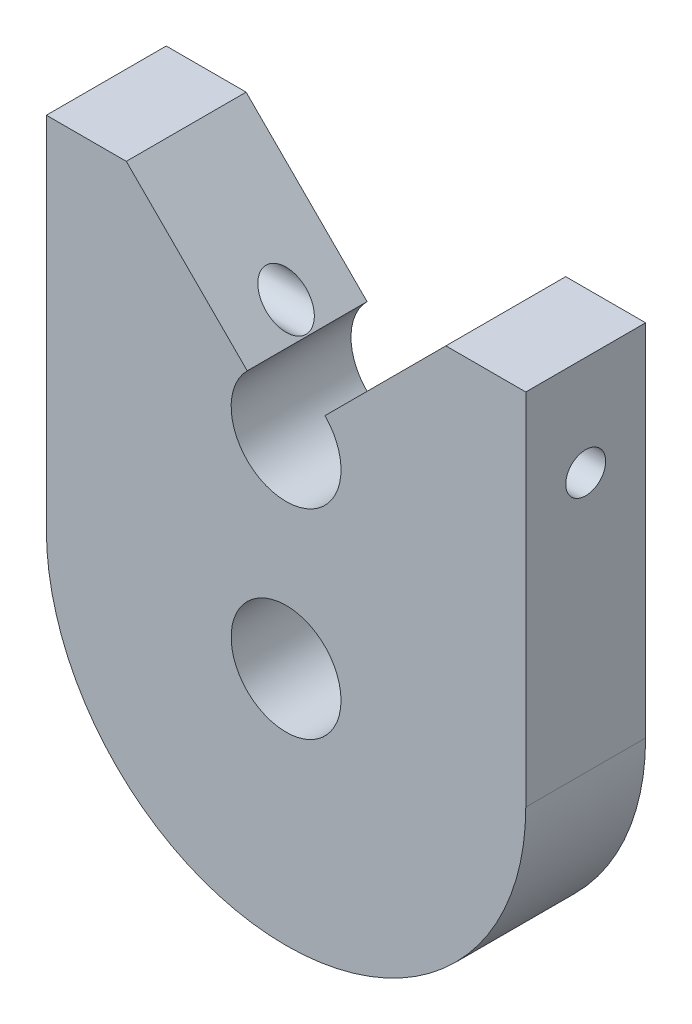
ISO-10303-21;
HEADER;
FILE_DESCRIPTION(('STEP AP214'),'2;1');
FILE_NAME('part.step','',(''),(''),'','','');
FILE_SCHEMA(('AUTOMOTIVE_DESIGN { 1 0 10303 214 1 1 1 1 }'));
ENDSEC;
DATA;
#1=APPLICATION_CONTEXT('core data for automotive mechanical design processes');
#2=APPLICATION_PROTOCOL_DEFINITION('international standard','automotive_design',2000,#1);
#3=PRODUCT_CONTEXT('',#1,'mechanical');
#4=PRODUCT('Part','Part','',(#3));
#5=PRODUCT_RELATED_PRODUCT_CATEGORY('part','',(#4));
#6=PRODUCT_DEFINITION_FORMATION('','',#4);
#7=PRODUCT_DEFINITION_CONTEXT('part definition',#1,'design');
#8=PRODUCT_DEFINITION('design','',#6,#7);
#9=PRODUCT_DEFINITION_SHAPE('','',#8);
#10=(LENGTH_UNIT() NAMED_UNIT(*) SI_UNIT(.MILLI.,.METRE.));
#11=(NAMED_UNIT(*) PLANE_ANGLE_UNIT() SI_UNIT($,.RADIAN.));
#12=(NAMED_UNIT(*) SI_UNIT($,.STERADIAN.) SOLID_ANGLE_UNIT());
#13=UNCERTAINTY_MEASURE_WITH_UNIT(LENGTH_MEASURE(1.E-05),#10,'distance_accuracy_value','');
#14=(GEOMETRIC_REPRESENTATION_CONTEXT(3) GLOBAL_UNCERTAINTY_ASSIGNED_CONTEXT((#13)) GLOBAL_UNIT_ASSIGNED_CONTEXT((#10,
#11,#12)) REPRESENTATION_CONTEXT('',''));
#15=CARTESIAN_POINT('',(0.,0.,0.));
#16=DIRECTION('',(0.,0.,1.));
#17=DIRECTION('',(1.,0.,0.));
#18=AXIS2_PLACEMENT_3D('',#15,#16,#17);
#19=CARTESIAN_POINT('',(0.,10.,6.));
#20=DIRECTION('',(0.,0.,1.));
#21=DIRECTION('',(1.,0.,0.));
#22=AXIS2_PLACEMENT_3D('',#19,#20,#21);
#23=PLANE('',#22);
#24=CARTESIAN_POINT('',(0.,10.,6.));
#25=DIRECTION('',(0.,0.,-1.));
#26=DIRECTION('',(1.,0.,0.));
#27=AXIS2_PLACEMENT_3D('',#24,#25,#26);
#28=CIRCLE('',#27,2.75);
#29=CARTESIAN_POINT('',(1.94454364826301,11.944543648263,6.));
#30=VERTEX_POINT('',#29);
#31=CARTESIAN_POINT('',(-1.94454364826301,11.944543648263,6.));
#32=VERTEX_POINT('',#31);
#33=EDGE_CURVE('E144',#30,#32,#28,.T.);
#34=ORIENTED_EDGE('',*,*,#33,.T.);
#35=DIRECTION('',(-0.707106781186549,0.707106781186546,0.));
#36=VECTOR('',#35,1.);
#37=CARTESIAN_POINT('',(-1.94454364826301,11.944543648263,6.));
#38=LINE('',#37,#36);
#39=CARTESIAN_POINT('',(-8.00000000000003,18.,6.));
#40=VERTEX_POINT('',#39);
#41=EDGE_CURVE('E92',#32,#40,#38,.T.);
#42=ORIENTED_EDGE('',*,*,#41,.T.);
#43=DIRECTION('',(-1.,0.,0.));
#44=VECTOR('',#43,1.);
#45=CARTESIAN_POINT('',(-12.,18.,6.));
#46=LINE('',#45,#44);
#47=CARTESIAN_POINT('',(-12.,18.,6.));
#48=VERTEX_POINT('',#47);
#49=EDGE_CURVE('E160',#40,#48,#46,.T.);
#50=ORIENTED_EDGE('',*,*,#49,.T.);
#51=DIRECTION('',(0.,-1.,0.));
#52=VECTOR('',#51,1.);
#53=CARTESIAN_POINT('',(-12.,0.,6.));
#54=LINE('',#53,#52);
#55=CARTESIAN_POINT('',(-12.,0.,6.));
#56=VERTEX_POINT('',#55);
#57=EDGE_CURVE('E173',#48,#56,#54,.T.);
#58=ORIENTED_EDGE('',*,*,#57,.T.);
#59=CARTESIAN_POINT('',(0.,0.,6.));
#60=DIRECTION('',(0.,0.,1.));
#61=DIRECTION('',(1.,0.,0.));
#62=AXIS2_PLACEMENT_3D('',#59,#60,#61);
#63=CIRCLE('',#62,12.);
#64=CARTESIAN_POINT('',(12.,0.,6.));
#65=VERTEX_POINT('',#64);
#66=EDGE_CURVE('E111',#56,#65,#63,.T.);
#67=ORIENTED_EDGE('',*,*,#66,.T.);
#68=DIRECTION('',(0.,1.,0.));
#69=VECTOR('',#68,1.);
#70=CARTESIAN_POINT('',(12.,0.,6.));
#71=LINE('',#70,#69);
#72=CARTESIAN_POINT('',(12.,18.,6.));
#73=VERTEX_POINT('',#72);
#74=EDGE_CURVE('E105',#65,#73,#71,.T.);
#75=ORIENTED_EDGE('',*,*,#74,.T.);
#76=DIRECTION('',(-1.,0.,0.));
#77=VECTOR('',#76,1.);
#78=CARTESIAN_POINT('',(12.,18.,6.));
#79=LINE('',#78,#77);
#80=CARTESIAN_POINT('',(8.00000000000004,18.,6.));
#81=VERTEX_POINT('',#80);
#82=EDGE_CURVE('E109',#73,#81,#79,.T.);
#83=ORIENTED_EDGE('',*,*,#82,.T.);
#84=DIRECTION('',(-0.707106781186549,-0.707106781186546,0.));
#85=VECTOR('',#84,1.);
#86=CARTESIAN_POINT('',(1.94454364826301,11.944543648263,6.));
#87=LINE('',#86,#85);
#88=EDGE_CURVE('E49',#81,#30,#87,.T.);
#89=ORIENTED_EDGE('',*,*,#88,.T.);
#90=EDGE_LOOP('',(#34,#42,#50,#58,#67,#75,#83,#89));
#91=FACE_BOUND('',#90,.T.);
#92=CARTESIAN_POINT('',(0.,0.,6.));
#93=DIRECTION('',(0.,0.,1.));
#94=DIRECTION('',(1.,0.,0.));
#95=AXIS2_PLACEMENT_3D('',#92,#93,#94);
#96=CIRCLE('',#95,2.75);
#97=CARTESIAN_POINT('',(2.75,0.,6.));
#98=VERTEX_POINT('',#97);
#99=EDGE_CURVE('E133',#98,#98,#96,.T.);
#100=ORIENTED_EDGE('',*,*,#99,.F.);
#101=EDGE_LOOP('',(#100));
#102=FACE_BOUND('',#101,.T.);
#103=ADVANCED_FACE('F31',(#91,#102),#23,.T.);
#104=CARTESIAN_POINT('',(0.,10.,0.));
#105=DIRECTION('',(0.,0.,1.));
#106=DIRECTION('',(1.,0.,0.));
#107=AXIS2_PLACEMENT_3D('',#104,#105,#106);
#108=PLANE('',#107);
#109=CARTESIAN_POINT('',(0.,10.,0.));
#110=DIRECTION('',(0.,0.,-1.));
#111=DIRECTION('',(1.,0.,0.));
#112=AXIS2_PLACEMENT_3D('',#109,#110,#111);
#113=CIRCLE('',#112,2.75);
#114=CARTESIAN_POINT('',(1.94454364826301,11.944543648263,0.));
#115=VERTEX_POINT('',#114);
#116=CARTESIAN_POINT('',(-1.94454364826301,11.944543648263,0.));
#117=VERTEX_POINT('',#116);
#118=EDGE_CURVE('E129',#115,#117,#113,.T.);
#119=ORIENTED_EDGE('',*,*,#118,.F.);
#120=DIRECTION('',(-0.707106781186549,-0.707106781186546,0.));
#121=VECTOR('',#120,1.);
#122=CARTESIAN_POINT('',(1.94454364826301,11.944543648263,0.));
#123=LINE('',#122,#121);
#124=CARTESIAN_POINT('',(8.00000000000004,18.,0.));
#125=VERTEX_POINT('',#124);
#126=EDGE_CURVE('E84',#125,#115,#123,.T.);
#127=ORIENTED_EDGE('',*,*,#126,.F.);
#128=DIRECTION('',(-1.,0.,0.));
#129=VECTOR('',#128,1.);
#130=CARTESIAN_POINT('',(12.,18.,0.));
#131=LINE('',#130,#129);
#132=CARTESIAN_POINT('',(12.,18.,0.));
#133=VERTEX_POINT('',#132);
#134=EDGE_CURVE('E78',#133,#125,#131,.T.);
#135=ORIENTED_EDGE('',*,*,#134,.F.);
#136=DIRECTION('',(0.,1.,0.));
#137=VECTOR('',#136,1.);
#138=CARTESIAN_POINT('',(12.,0.,0.));
#139=LINE('',#138,#137);
#140=CARTESIAN_POINT('',(12.,0.,0.));
#141=VERTEX_POINT('',#140);
#142=EDGE_CURVE('E119',#141,#133,#139,.T.);
#143=ORIENTED_EDGE('',*,*,#142,.F.);
#144=CARTESIAN_POINT('',(0.,0.,0.));
#145=DIRECTION('',(0.,0.,1.));
#146=DIRECTION('',(1.,0.,0.));
#147=AXIS2_PLACEMENT_3D('',#144,#145,#146);
#148=CIRCLE('',#147,12.);
#149=CARTESIAN_POINT('',(-12.,0.,0.));
#150=VERTEX_POINT('',#149);
#151=EDGE_CURVE('E139',#150,#141,#148,.T.);
#152=ORIENTED_EDGE('',*,*,#151,.F.);
#153=DIRECTION('',(0.,-1.,0.));
#154=VECTOR('',#153,1.);
#155=CARTESIAN_POINT('',(-12.,0.,0.));
#156=LINE('',#155,#154);
#157=CARTESIAN_POINT('',(-12.,18.,0.));
#158=VERTEX_POINT('',#157);
#159=EDGE_CURVE('E137',#158,#150,#156,.T.);
#160=ORIENTED_EDGE('',*,*,#159,.F.);
#161=DIRECTION('',(-1.,0.,0.));
#162=VECTOR('',#161,1.);
#163=CARTESIAN_POINT('',(-12.,18.,0.));
#164=LINE('',#163,#162);
#165=CARTESIAN_POINT('',(-8.00000000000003,18.,0.));
#166=VERTEX_POINT('',#165);
#167=EDGE_CURVE('E135',#166,#158,#164,.T.);
#168=ORIENTED_EDGE('',*,*,#167,.F.);
#169=DIRECTION('',(-0.707106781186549,0.707106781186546,0.));
#170=VECTOR('',#169,1.);
#171=CARTESIAN_POINT('',(-1.94454364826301,11.944543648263,0.));
#172=LINE('',#171,#170);
#173=EDGE_CURVE('E132',#117,#166,#172,.T.);
#174=ORIENTED_EDGE('',*,*,#173,.F.);
#175=EDGE_LOOP('',(#119,#127,#135,#143,#152,#160,#168,#174));
#176=FACE_BOUND('',#175,.T.);
#177=CARTESIAN_POINT('',(0.,0.,0.));
#178=DIRECTION('',(0.,0.,1.));
#179=DIRECTION('',(1.,0.,0.));
#180=AXIS2_PLACEMENT_3D('',#177,#178,#179);
#181=CIRCLE('',#180,2.75);
#182=CARTESIAN_POINT('',(2.75,0.,0.));
#183=VERTEX_POINT('',#182);
#184=EDGE_CURVE('E179',#183,#183,#181,.T.);
#185=ORIENTED_EDGE('',*,*,#184,.T.);
#186=EDGE_LOOP('',(#185));
#187=FACE_BOUND('',#186,.T.);
#188=ADVANCED_FACE('F164',(#176,#187),#108,.F.);
#189=CARTESIAN_POINT('',(0.,10.,6.));
#190=DIRECTION('',(0.,0.,-1.));
#191=DIRECTION('',(-1.,0.,0.));
#192=AXIS2_PLACEMENT_3D('',#189,#190,#191);
#193=CYLINDRICAL_SURFACE('',#192,2.75);
#194=ORIENTED_EDGE('',*,*,#118,.T.);
#195=DIRECTION('',(0.,0.,-1.));
#196=VECTOR('',#195,1.);
#197=CARTESIAN_POINT('',(-1.94454364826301,11.944543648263,6.));
#198=LINE('',#197,#196);
#199=EDGE_CURVE('E11',#32,#117,#198,.T.);
#200=ORIENTED_EDGE('',*,*,#199,.F.);
#201=ORIENTED_EDGE('',*,*,#33,.F.);
#202=DIRECTION('',(0.,0.,-1.));
#203=VECTOR('',#202,1.);
#204=CARTESIAN_POINT('',(1.94454364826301,11.944543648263,6.));
#205=LINE('',#204,#203);
#206=EDGE_CURVE('E125',#30,#115,#205,.T.);
#207=ORIENTED_EDGE('',*,*,#206,.T.);
#208=EDGE_LOOP('',(#194,#200,#201,#207));
#209=FACE_BOUND('',#208,.T.);
#210=ADVANCED_FACE('F33',(#209),#193,.F.);
#211=CARTESIAN_POINT('',(-1.94454364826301,11.944543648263,6.));
#212=DIRECTION('',(-0.707106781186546,-0.707106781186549,0.));
#213=DIRECTION('',(0.707106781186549,-0.707106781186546,0.));
#214=AXIS2_PLACEMENT_3D('',#211,#212,#213);
#215=PLANE('',#214);
#216=CARTESIAN_POINT('',(-3.00000000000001,13.,3.));
#217=DIRECTION('',(-0.707106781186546,-0.707106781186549,0.));
#218=DIRECTION('',(0.707106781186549,-0.707106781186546,0.));
#219=AXIS2_PLACEMENT_3D('',#216,#217,#218);
#220=ELLIPSE('',#219,1.4142135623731,1.);
#221=CARTESIAN_POINT('',(-2.00000000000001,12.,3.));
#222=VERTEX_POINT('',#221);
#223=EDGE_CURVE('E182',#222,#222,#220,.T.);
#224=ORIENTED_EDGE('',*,*,#223,.T.);
#225=EDGE_LOOP('',(#224));
#226=FACE_BOUND('',#225,.T.);
#227=ORIENTED_EDGE('',*,*,#173,.T.);
#228=DIRECTION('',(0.,0.,-1.));
#229=VECTOR('',#228,1.);
#230=CARTESIAN_POINT('',(-8.00000000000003,18.,6.));
#231=LINE('',#230,#229);
#232=EDGE_CURVE('E41',#40,#166,#231,.T.);
#233=ORIENTED_EDGE('',*,*,#232,.F.);
#234=ORIENTED_EDGE('',*,*,#41,.F.);
#235=ORIENTED_EDGE('',*,*,#199,.T.);
#236=EDGE_LOOP('',(#227,#233,#234,#235));
#237=FACE_BOUND('',#236,.T.);
#238=ADVANCED_FACE('F231',(#226,#237),#215,.F.);
#239=CARTESIAN_POINT('',(-12.,18.,6.));
#240=DIRECTION('',(0.,-1.,0.));
#241=DIRECTION('',(1.,0.,0.));
#242=AXIS2_PLACEMENT_3D('',#239,#240,#241);
#243=PLANE('',#242);
#244=ORIENTED_EDGE('',*,*,#167,.T.);
#245=DIRECTION('',(0.,0.,-1.));
#246=VECTOR('',#245,1.);
#247=CARTESIAN_POINT('',(-12.,18.,6.));
#248=LINE('',#247,#246);
#249=EDGE_CURVE('E151',#48,#158,#248,.T.);
#250=ORIENTED_EDGE('',*,*,#249,.F.);
#251=ORIENTED_EDGE('',*,*,#49,.F.);
#252=ORIENTED_EDGE('',*,*,#232,.T.);
#253=EDGE_LOOP('',(#244,#250,#251,#252));
#254=FACE_BOUND('',#253,.T.);
#255=ADVANCED_FACE('F158',(#254),#243,.F.);
#256=CARTESIAN_POINT('',(-12.,0.,6.));
#257=DIRECTION('',(1.,0.,0.));
#258=DIRECTION('',(0.,0.,-1.));
#259=AXIS2_PLACEMENT_3D('',#256,#257,#258);
#260=PLANE('',#259);
#261=CARTESIAN_POINT('',(-12.,13.,3.));
#262=DIRECTION('',(1.,0.,0.));
#263=DIRECTION('',(0.,0.,-1.));
#264=AXIS2_PLACEMENT_3D('',#261,#262,#263);
#265=CIRCLE('',#264,1.);
#266=CARTESIAN_POINT('',(-12.,13.,2.));
#267=VERTEX_POINT('',#266);
#268=EDGE_CURVE('E190',#267,#267,#265,.T.);
#269=ORIENTED_EDGE('',*,*,#268,.T.);
#270=EDGE_LOOP('',(#269));
#271=FACE_BOUND('',#270,.T.);
#272=ORIENTED_EDGE('',*,*,#159,.T.);
#273=DIRECTION('',(0.,0.,-1.));
#274=VECTOR('',#273,1.);
#275=CARTESIAN_POINT('',(-12.,0.,6.));
#276=LINE('',#275,#274);
#277=EDGE_CURVE('E148',#56,#150,#276,.T.);
#278=ORIENTED_EDGE('',*,*,#277,.F.);
#279=ORIENTED_EDGE('',*,*,#57,.F.);
#280=ORIENTED_EDGE('',*,*,#249,.T.);
#281=EDGE_LOOP('',(#272,#278,#279,#280));
#282=FACE_BOUND('',#281,.T.);
#283=ADVANCED_FACE('F169',(#271,#282),#260,.F.);
#284=CARTESIAN_POINT('',(0.,0.,6.));
#285=DIRECTION('',(0.,0.,-1.));
#286=DIRECTION('',(-1.,0.,0.));
#287=AXIS2_PLACEMENT_3D('',#284,#285,#286);
#288=CYLINDRICAL_SURFACE('',#287,12.);
#289=ORIENTED_EDGE('',*,*,#151,.T.);
#290=DIRECTION('',(0.,0.,-1.));
#291=VECTOR('',#290,1.);
#292=CARTESIAN_POINT('',(12.,0.,6.));
#293=LINE('',#292,#291);
#294=EDGE_CURVE('E120',#65,#141,#293,.T.);
#295=ORIENTED_EDGE('',*,*,#294,.F.);
#296=ORIENTED_EDGE('',*,*,#66,.F.);
#297=ORIENTED_EDGE('',*,*,#277,.T.);
#298=EDGE_LOOP('',(#289,#295,#296,#297));
#299=FACE_BOUND('',#298,.T.);
#300=ADVANCED_FACE('F172',(#299),#288,.T.);
#301=CARTESIAN_POINT('',(12.,0.,6.));
#302=DIRECTION('',(-1.,0.,0.));
#303=DIRECTION('',(0.,0.,1.));
#304=AXIS2_PLACEMENT_3D('',#301,#302,#303);
#305=PLANE('',#304);
#306=CARTESIAN_POINT('',(12.,13.,3.));
#307=DIRECTION('',(1.,0.,0.));
#308=DIRECTION('',(0.,0.,-1.));
#309=AXIS2_PLACEMENT_3D('',#306,#307,#308);
#310=CIRCLE('',#309,1.);
#311=CARTESIAN_POINT('',(12.,13.,2.));
#312=VERTEX_POINT('',#311);
#313=EDGE_CURVE('E187',#312,#312,#310,.T.);
#314=ORIENTED_EDGE('',*,*,#313,.F.);
#315=EDGE_LOOP('',(#314));
#316=FACE_BOUND('',#315,.T.);
#317=ORIENTED_EDGE('',*,*,#142,.T.);
#318=DIRECTION('',(0.,0.,-1.));
#319=VECTOR('',#318,1.);
#320=CARTESIAN_POINT('',(12.,18.,6.));
#321=LINE('',#320,#319);
#322=EDGE_CURVE('E116',#73,#133,#321,.T.);
#323=ORIENTED_EDGE('',*,*,#322,.F.);
#324=ORIENTED_EDGE('',*,*,#74,.F.);
#325=ORIENTED_EDGE('',*,*,#294,.T.);
#326=EDGE_LOOP('',(#317,#323,#324,#325));
#327=FACE_BOUND('',#326,.T.);
#328=ADVANCED_FACE('F117',(#316,#327),#305,.F.);
#329=CARTESIAN_POINT('',(12.,18.,6.));
#330=DIRECTION('',(0.,-1.,0.));
#331=DIRECTION('',(1.,0.,0.));
#332=AXIS2_PLACEMENT_3D('',#329,#330,#331);
#333=PLANE('',#332);
#334=ORIENTED_EDGE('',*,*,#134,.T.);
#335=DIRECTION('',(0.,0.,-1.));
#336=VECTOR('',#335,1.);
#337=CARTESIAN_POINT('',(8.00000000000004,18.,6.));
#338=LINE('',#337,#336);
#339=EDGE_CURVE('E121',#81,#125,#338,.T.);
#340=ORIENTED_EDGE('',*,*,#339,.F.);
#341=ORIENTED_EDGE('',*,*,#82,.F.);
#342=ORIENTED_EDGE('',*,*,#322,.T.);
#343=EDGE_LOOP('',(#334,#340,#341,#342));
#344=FACE_BOUND('',#343,.T.);
#345=ADVANCED_FACE('F123',(#344),#333,.F.);
#346=CARTESIAN_POINT('',(1.94454364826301,11.944543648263,6.));
#347=DIRECTION('',(0.707106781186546,-0.707106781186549,0.));
#348=DIRECTION('',(0.707106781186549,0.707106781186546,0.));
#349=AXIS2_PLACEMENT_3D('',#346,#347,#348);
#350=PLANE('',#349);
#351=CARTESIAN_POINT('',(3.00000000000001,13.,3.));
#352=DIRECTION('',(0.707106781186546,-0.707106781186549,0.));
#353=DIRECTION('',(0.707106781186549,0.707106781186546,0.));
#354=AXIS2_PLACEMENT_3D('',#351,#352,#353);
#355=ELLIPSE('',#354,1.4142135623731,1.);
#356=CARTESIAN_POINT('',(4.00000000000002,14.,3.));
#357=VERTEX_POINT('',#356);
#358=EDGE_CURVE('E35',#357,#357,#355,.T.);
#359=ORIENTED_EDGE('',*,*,#358,.T.);
#360=EDGE_LOOP('',(#359));
#361=FACE_BOUND('',#360,.T.);
#362=ORIENTED_EDGE('',*,*,#126,.T.);
#363=ORIENTED_EDGE('',*,*,#206,.F.);
#364=ORIENTED_EDGE('',*,*,#88,.F.);
#365=ORIENTED_EDGE('',*,*,#339,.T.);
#366=EDGE_LOOP('',(#362,#363,#364,#365));
#367=FACE_BOUND('',#366,.T.);
#368=ADVANCED_FACE('F197',(#361,#367),#350,.F.);
#369=CARTESIAN_POINT('',(0.,0.,6.));
#370=DIRECTION('',(0.,0.,-1.));
#371=DIRECTION('',(-1.,0.,0.));
#372=AXIS2_PLACEMENT_3D('',#369,#370,#371);
#373=CYLINDRICAL_SURFACE('',#372,2.75);
#374=ORIENTED_EDGE('',*,*,#99,.T.);
#375=EDGE_LOOP('',(#374));
#376=FACE_BOUND('',#375,.T.);
#377=ORIENTED_EDGE('',*,*,#184,.F.);
#378=EDGE_LOOP('',(#377));
#379=FACE_BOUND('',#378,.T.);
#380=ADVANCED_FACE('F202',(#376,#379),#373,.F.);
#381=CARTESIAN_POINT('',(-12.,13.,3.));
#382=DIRECTION('',(1.,0.,0.));
#383=DIRECTION('',(0.,0.,-1.));
#384=AXIS2_PLACEMENT_3D('',#381,#382,#383);
#385=CYLINDRICAL_SURFACE('',#384,1.);
#386=ORIENTED_EDGE('',*,*,#313,.T.);
#387=EDGE_LOOP('',(#386));
#388=FACE_BOUND('',#387,.T.);
#389=ORIENTED_EDGE('',*,*,#358,.F.);
#390=EDGE_LOOP('',(#389));
#391=FACE_BOUND('',#390,.T.);
#392=ADVANCED_FACE('F199',(#388,#391),#385,.F.);
#393=ORIENTED_EDGE('',*,*,#268,.F.);
#394=EDGE_LOOP('',(#393));
#395=FACE_BOUND('',#394,.T.);
#396=ORIENTED_EDGE('',*,*,#223,.F.);
#397=EDGE_LOOP('',(#396));
#398=FACE_BOUND('',#397,.T.);
#399=ADVANCED_FACE('F201',(#395,#398),#385,.F.);
#400=CLOSED_SHELL('',(#103,#188,#210,#238,#255,#283,#300,#328,#345,#368,#380,#392,#399));
#401=MANIFOLD_SOLID_BREP('B2',#400);
#402=ADVANCED_BREP_SHAPE_REPRESENTATION('',(#18,#401),#14);
#403=SHAPE_DEFINITION_REPRESENTATION(#9,#402);
ENDSEC;
END-ISO-10303-21;
